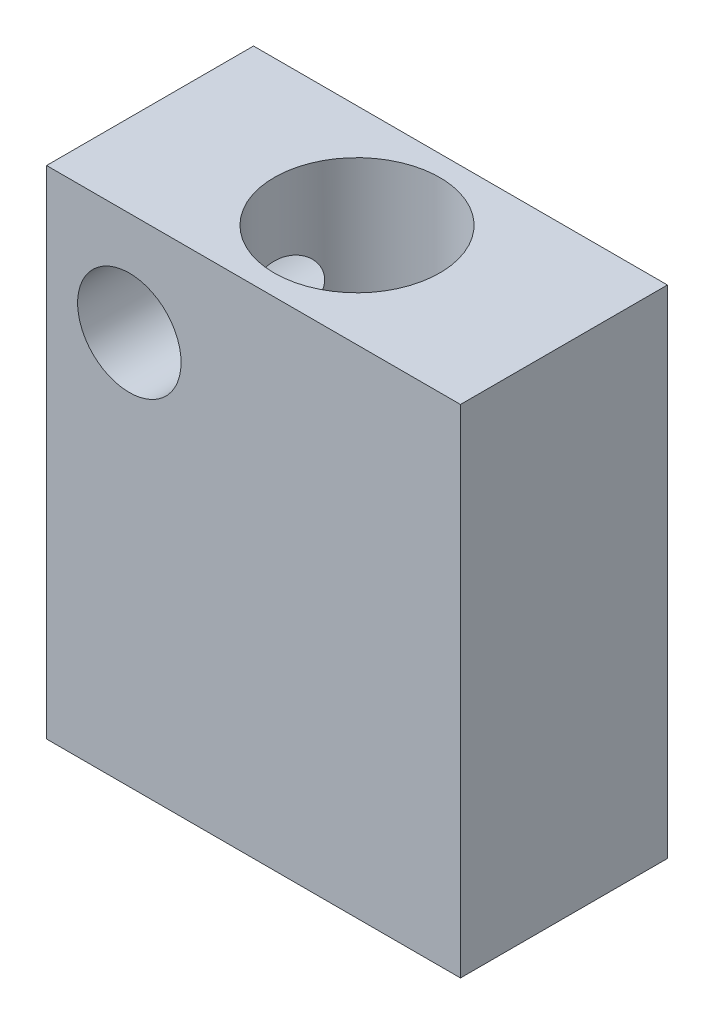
from build123d import *

# Parameters (mm, degrees)
SKETCH2_W           = 100
SKETCH2_H           = 50
BOSS_EXTRUDE1_DEPTH = 120
SKETCH3_R           = 20
CUT_EXTRUDE1_DEPTH  = 133.382022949
SKETCH4_R           = 12.5
CUT_EXTRUDE2_DEPTH  = 140.283882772


with BuildPart() as part:
    # Sketch2 → Boss-Extrude1 (new body)
    with BuildSketch(Plane(origin=(0, 0, 0), x_dir=(1, 0, 0), z_dir=(0, 1, 0))):
        Rectangle(SKETCH2_W, SKETCH2_H)
    extrude(amount=-BOSS_EXTRUDE1_DEPTH)

    # Sketch3 → Cut-Extrude1 (cut, through all)
    with BuildSketch(Plane(origin=(0, 0, 0), x_dir=(1, 0, 0), z_dir=(0, 1, 0))):
        with Locations(Location((0, 0, 0), (0, 0, 270))):
            Circle(SKETCH3_R)
    extrude(amount=-CUT_EXTRUDE1_DEPTH, mode=Mode.SUBTRACT)

    # Sketch4 → Cut-Extrude2 (cut, through all)
    with BuildSketch(Plane.XY.offset(25)):
        with Locations((-30, -25)):
            Circle(SKETCH4_R)
    extrude(amount=-CUT_EXTRUDE2_DEPTH, mode=Mode.SUBTRACT)


solid = part.part
